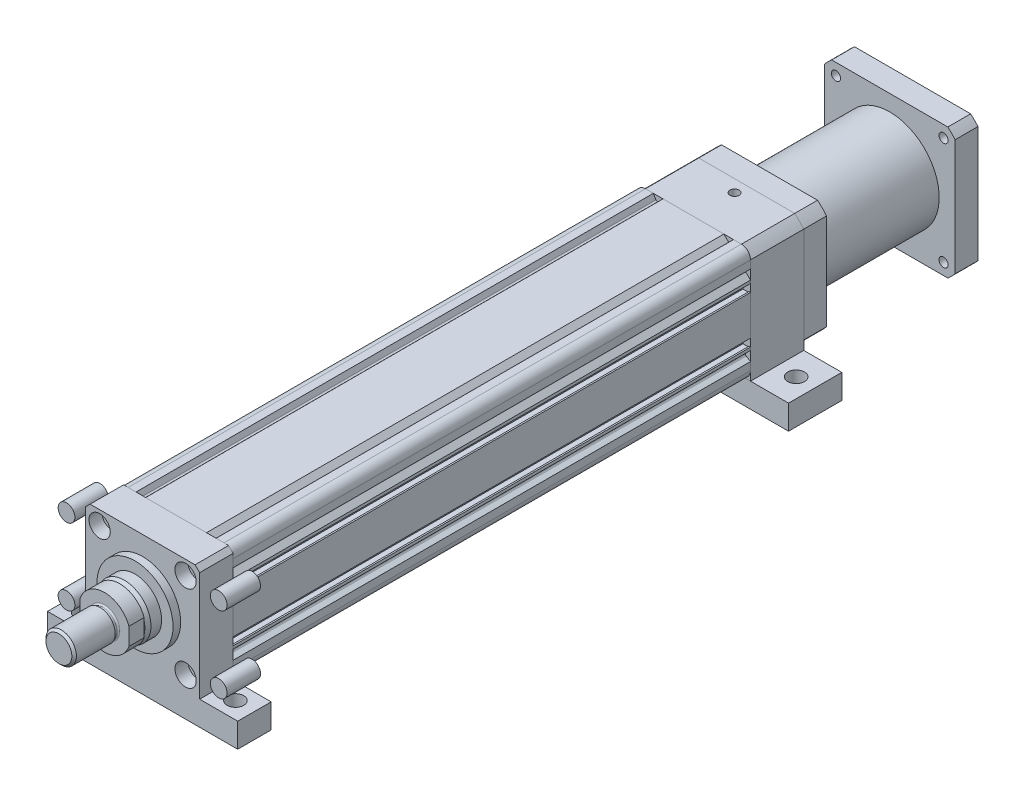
from build123d import *

# Parameters (mm, degrees)
SKETCH_1_R          = 31.5
SKETCH_1_R_2        = 3.35
EXTRUDE_1_DEPTH     = 340
SKETCH_2_R          = 5.5
EXTRUDE_1_2_DEPTH   = 22
EXTRUDE_1_2_2_DEPTH = 22
EXTRUDE_1_2_3_DEPTH = 22
EXTRUDE_1_2_4_DEPTH = 22
SKETCH_2_R_2        = 4.25
EXTRUDE_1_2_5_DEPTH = 22
SKETCH_3_R          = 7
SKETCH_3_R_2        = 4.25
CUT_EXTRUDE_1_DEPTH = 8.5
SKETCH_3_3_R        = 25
EXTRUDE_2_DEPTH     = 5
SKETCH_5_R          = 17.5
EXTRUDE_3_DEPTH     = 10
CHAMFER_1_SIZE      = 3
CHAMFER_1_SIZE2     = 1
EXTRUDE_4_DEPTH     = 10
SKETCH_8_R          = 9
EXTRUDE_5_DEPTH     = 3
SKETCH_9_R          = 10
EXTRUDE_6_DEPTH     = 27
CHAMFER_2_SIZE      = 1.5
FILLET_1_R          = 1
EXTRUDE_7_DEPTH     = 35
SKETCH_11_R         = 3
CUT_EXTRUDE_2_DEPTH = 5
EXTRUDE_8_DEPTH     = 15
SKETCH_13_R         = 32.5
EXTRUDE_9_DEPTH     = 79
SKETCH_14_R         = 3
EXTRUDE_10_DEPTH    = 15
SKETCH_15_R         = 40
CUT_EXTRUDE_3_DEPTH = 6
SKETCH_15_3_R       = 26
CUT_EXTRUDE_4_DEPTH = 101
SKETCH_18_W         = 125
SKETCH_18_H         = 22
SKETCH_18_R         = 5.5
SKETCH_18_H_2       = 35
EXTRUDE_11_DEPTH    = 16
CUT_EXTRUDE_5_DEPTH = 22
CHAMFER_3_SIZE      = 3


with BuildPart() as part:
    # Sketch 1 → Extrude 1 (new body)
    with BuildSketch(Plane.XY):
        with BuildLine():
            Line((-31.5, 37.5), (-26.33, 37.5))
            Line((-26.33, 37.5), (-24.66467188, 34.615567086))
            ThreePointArc((-24.66467188, 34.615567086), (-23.929172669, 34.124122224), (-23.091539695, 34.408460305))
            Line((-23.091539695, 34.408460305), (-20, 37.5))
            Line((-20, 37.5), (20, 37.5))
            Line((20, 37.5), (23.091539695, 34.408460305))
            ThreePointArc((23.091539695, 34.408460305), (23.929172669, 34.124122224), (24.66467188, 34.615567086))
            Line((24.66467188, 34.615567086), (26.33, 37.5))
            Line((26.33, 37.5), (31.5, 37.5))
            ThreePointArc((31.5, 37.5), (35.742640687, 35.742640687), (37.5, 31.5))
            Line((37.5, 31.5), (37.5, 26.33))
            Line((37.5, 26.33), (34.615567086, 24.66467188))
            ThreePointArc((34.615567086, 24.66467188), (34.124122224, 23.929172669), (34.408460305, 23.091539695))
            Line((34.408460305, 23.091539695), (37.5, 20))
            Line((37.5, 20), (37.5, 18.1))
            Line((37.5, 18.1), (36.5, 18.1))
            Line((36.5, 18.1), (36.5, 18.7))
            Line((36.5, 18.7), (32.5, 18.7))
            Line((32.5, 18.7), (32.5, 12.4))
            Line((32.5, 12.4), (36.5, 12.4))
            Line((36.5, 12.4), (36.5, 13))
            Line((36.5, 13), (37.5, 13))
            Line((37.5, 13), (37.5, -13))
            Line((37.5, -13), (36.5, -13))
            Line((36.5, -13), (36.5, -12.4))
            Line((36.5, -12.4), (32.5, -12.4))
            Line((32.5, -12.4), (32.5, -18.7))
            Line((32.5, -18.7), (36.5, -18.7))
            Line((36.5, -18.7), (36.5, -18.1))
            Line((36.5, -18.1), (37.5, -18.1))
            Line((37.5, -18.1), (37.5, -20))
            Line((37.5, -20), (34.408460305, -23.091539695))
            ThreePointArc((34.408460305, -23.091539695), (34.124122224, -23.929172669), (34.615567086, -24.66467188))
            Line((34.615567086, -24.66467188), (37.5, -26.33))
            Line((37.5, -26.33), (37.5, -31.5))
            ThreePointArc((37.5, -31.5), (35.742640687, -35.742640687), (31.5, -37.5))
            Line((31.5, -37.5), (26.33, -37.5))
            Line((26.33, -37.5), (24.66467188, -34.615567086))
            ThreePointArc((24.66467188, -34.615567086), (23.929172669, -34.124122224), (23.091539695, -34.408460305))
            Line((23.091539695, -34.408460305), (20, -37.5))
            Line((20, -37.5), (18.1, -37.5))
            Line((18.1, -37.5), (18.1, -36.5))
            Line((18.1, -36.5), (18.7, -36.5))
            Line((18.7, -36.5), (18.7, -33.945032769))
            Line((18.7, -33.945032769), (12.4, -33.945032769))
            Line((12.4, -33.945032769), (12.4, -36.5))
            Line((12.4, -36.5), (13, -36.5))
            Line((13, -36.5), (13, -37.5))
            Line((13, -37.5), (-13, -37.5))
            Line((-13, -37.5), (-13, -36.5))
            Line((-13, -36.5), (-12.4, -36.5))
            Line((-12.4, -36.5), (-12.4, -33.945032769))
            Line((-12.4, -33.945032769), (-18.7, -33.945032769))
            Line((-18.7, -33.945032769), (-18.7, -36.5))
            Line((-18.7, -36.5), (-18.1, -36.5))
            Line((-18.1, -36.5), (-18.1, -37.5))
            Line((-18.1, -37.5), (-20, -37.5))
            Line((-20, -37.5), (-23.091539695, -34.408460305))
            ThreePointArc((-23.091539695, -34.408460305), (-23.929172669, -34.124122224), (-24.66467188, -34.615567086))
            Line((-24.66467188, -34.615567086), (-26.33, -37.5))
            Line((-26.33, -37.5), (-31.5, -37.5))
            ThreePointArc((-31.5, -37.5), (-35.742640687, -35.742640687), (-37.5, -31.5))
            Line((-37.5, -31.5), (-37.5, -26.33))
            Line((-37.5, -26.33), (-34.615567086, -24.66467188))
            ThreePointArc((-34.615567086, -24.66467188), (-34.124122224, -23.929172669), (-34.408460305, -23.091539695))
            Line((-34.408460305, -23.091539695), (-37.5, -20))
            Line((-37.5, -20), (-37.5, -18.1))
            Line((-37.5, -18.1), (-36.5, -18.1))
            Line((-36.5, -18.1), (-36.5, -18.7))
            Line((-36.5, -18.7), (-32.5, -18.7))
            Line((-32.5, -18.7), (-32.5, -12.4))
            Line((-32.5, -12.4), (-36.5, -12.4))
            Line((-36.5, -12.4), (-36.5, -13))
            Line((-36.5, -13), (-37.5, -13))
            Line((-37.5, -13), (-37.5, 13))
            Line((-37.5, 13), (-36.5, 13))
            Line((-36.5, 13), (-36.5, 12.4))
            Line((-36.5, 12.4), (-32.5, 12.4))
            Line((-32.5, 12.4), (-32.5, 18.7))
            Line((-32.5, 18.7), (-36.5, 18.7))
            Line((-36.5, 18.7), (-36.5, 18.1))
            Line((-36.5, 18.1), (-37.5, 18.1))
            Line((-37.5, 18.1), (-37.5, 20))
            Line((-37.5, 20), (-34.408460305, 23.091539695))
            ThreePointArc((-34.408460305, 23.091539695), (-34.124122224, 23.929172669), (-34.615567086, 24.66467188))
            Line((-34.615567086, 24.66467188), (-37.5, 26.33))
            Line((-37.5, 26.33), (-37.5, 31.5))
            ThreePointArc((-37.5, 31.5), (-35.742640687, 35.742640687), (-31.5, 37.5))
        make_face()
        Circle(SKETCH_1_R, mode=Mode.SUBTRACT)
        with Locations((-28.25, 28.25)):
            Circle(SKETCH_1_R_2, mode=Mode.SUBTRACT)
        with Locations(Location((28.25, 28.25, 0), (0, 0, 180))):
            Circle(SKETCH_1_R_2, mode=Mode.SUBTRACT)
        with Locations((28.25, -28.25)):
            Circle(SKETCH_1_R_2, mode=Mode.SUBTRACT)
        with Locations(Location((-28.25, -28.25, 0), (0, 0, 180))):
            Circle(SKETCH_1_R_2, mode=Mode.SUBTRACT)
    extrude(amount=EXTRUDE_1_DEPTH)


with BuildPart() as body_2:
    # Sketch 2 → Extrude 1 2 (new body)
    with BuildSketch(Plane.XY.offset(340)):
        with Locations((-50, 25)):
            Circle(SKETCH_2_R)
    extrude(amount=EXTRUDE_1_2_DEPTH)


with BuildPart() as body_3:
    # Sketch 2 → Extrude 1 2 2 (new body)
    with BuildSketch(Plane.XY.offset(340)):
        with Locations(Location((50, 25, 0), (0, 0, 180))):
            Circle(SKETCH_2_R)
    extrude(amount=EXTRUDE_1_2_2_DEPTH)


with BuildPart() as body_4:
    # Sketch 2 → Extrude 1 2 3 (new body)
    with BuildSketch(Plane.XY.offset(340)):
        with Locations(Location((-50, -25, 0), (0, 0, 180))):
            Circle(SKETCH_2_R)
    extrude(amount=EXTRUDE_1_2_3_DEPTH)


with BuildPart() as body_5:
    # Sketch 2 → Extrude 1 2 4 (new body)
    with BuildSketch(Plane.XY.offset(340)):
        with Locations((50, -25)):
            Circle(SKETCH_2_R)
    extrude(amount=EXTRUDE_1_2_4_DEPTH)


with BuildPart() as body_6:
    # Sketch 2 → Extrude 1 2 5 (new body)
    with BuildSketch(Plane.XY.offset(340)):
        Polygon((-40, 37), (-37, 40), (37, 40), (40, 37), (40, -37), (40, -40), (37, -40), (-37, -40), (-40, -40), (-40, -37), align=None)
        with Locations((-28.25, 28.25)):
            Circle(SKETCH_2_R_2, mode=Mode.SUBTRACT)
        with Locations(Location((28.25, 28.25, 0), (0, 0, 180))):
            Circle(SKETCH_2_R_2, mode=Mode.SUBTRACT)
        with Locations(Location((-28.25, -28.25, 0), (0, 0, 180))):
            Circle(SKETCH_2_R_2, mode=Mode.SUBTRACT)
        with Locations((28.25, -28.25)):
            Circle(SKETCH_2_R_2, mode=Mode.SUBTRACT)
    extrude(amount=EXTRUDE_1_2_5_DEPTH)

    # Sketch 3 → Cut-Extrude 1 (cut)
    # profile 1 of 4: a face of its own
    with BuildSketch(Plane.XY.offset(362)):
        with Locations((28.25, -28.25)):
            Circle(SKETCH_3_R)
        with Locations((28.25, -28.25)):
            Circle(SKETCH_3_R_2, mode=Mode.SUBTRACT)
    # profile 2 of 4: a face of its own
    with BuildSketch(Plane.XY.offset(362)):
        with Locations((-28.25, -28.25)):
            Circle(SKETCH_3_R)
        with Locations(Location((-28.25, -28.25, 0), (0, 0, 180))):
            Circle(SKETCH_3_R_2, mode=Mode.SUBTRACT)
    # profile 3 of 4: a face of its own
    with BuildSketch(Plane.XY.offset(362)):
        with Locations((-28.25, 28.25)):
            Circle(SKETCH_3_R)
    # profile 4 of 4: a face of its own
    with BuildSketch(Plane.XY.offset(362)):
        with Locations((28.25, 28.25)):
            Circle(SKETCH_3_R)
    extrude(amount=-CUT_EXTRUDE_1_DEPTH, mode=Mode.SUBTRACT)

    # Sketch 3_3 → Extrude 2 (add)
    with BuildSketch(Plane.XY.offset(362)):
        Circle(SKETCH_3_3_R)
    extrude(amount=EXTRUDE_2_DEPTH)

    # Sketch 5 → Extrude 3 (add)
    with BuildSketch(Plane.XY.offset(367)):
        Circle(SKETCH_5_R)
    extrude(amount=EXTRUDE_3_DEPTH)

    # Chamfer 1
    chamfer_1_edges = [body_6.edges().sort_by_distance(p)[0] for p in [
        (-17.5, 0, 377),
    ]]
    chamfer_1_side = [body_6.faces().sort_by_distance(p)[0] for p in [
        (-17.5, 0, 372),
    ]]
    chamfer(chamfer_1_edges, length=CHAMFER_1_SIZE, length2=CHAMFER_1_SIZE2, reference=chamfer_1_side[0])

    # Sketch 6 → Extrude 4 (add)
    with BuildSketch(Plane.XY.offset(377)):
        with BuildLine():
            Line((-16, 5.744562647), (-16, -5.744562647))
            ThreePointArc((-16, -5.744562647), (0, -17), (16, -5.744562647))
            Line((16, -5.744562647), (16, 5.744562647))
            ThreePointArc((16, 5.744562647), (0, 17), (-16, 5.744562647))
        make_face()
    extrude(amount=EXTRUDE_4_DEPTH)

    # Sketch 8 → Extrude 5 (add)
    with BuildSketch(Plane.XY.offset(387)):
        Circle(SKETCH_8_R)
    extrude(amount=EXTRUDE_5_DEPTH)

    # Sketch 9 → Extrude 6 (add)
    with BuildSketch(Plane.XY.offset(390)):
        Circle(SKETCH_9_R)
    extrude(amount=EXTRUDE_6_DEPTH)

    # Chamfer 2
    chamfer_2_edges = [body_6.edges().sort_by_distance(p)[0] for p in [
        (-10, 0, 417),
    ]]
    chamfer(chamfer_2_edges, length=CHAMFER_2_SIZE)

    # Fillet 1
    fillet_1_edges = [body_6.edges().sort_by_distance(p)[0] for p in [
        (-9, 0, 387),
    ]]
    fillet(fillet_1_edges, radius=FILLET_1_R)

    # Sketch 18 → Extrude 11 (add)
    # profile 1 of 2: a face of its own
    with BuildSketch(Plane.XZ.offset(37.5)):
        with Locations((0, 351)):
            Rectangle(SKETCH_18_W, SKETCH_18_H)
        with Locations(Location((-50, 351, 0), (0, 0, 270))):
            Circle(SKETCH_18_R, mode=Mode.SUBTRACT)
        with Locations(Location((50, 351, 0), (0, 0, 270))):
            Circle(SKETCH_18_R, mode=Mode.SUBTRACT)
    # profile 2 of 2: a face of its own
    with BuildSketch(Plane.XZ.offset(37.5)):
        with Locations((0, -17.5)):
            Rectangle(SKETCH_18_W, SKETCH_18_H_2)
        with Locations(Location((-50, -17.5, 0), (0, 0, 270))):
            Circle(SKETCH_18_R, mode=Mode.SUBTRACT)
        with Locations(Location((50, -17.5, 0), (0, 0, 270))):
            Circle(SKETCH_18_R, mode=Mode.SUBTRACT)
    extrude(amount=EXTRUDE_11_DEPTH)


with BuildPart() as body_7:
    # Sketch 10 → Extrude 7 (new body)
    with BuildSketch(Plane(origin=(0, 0, 0), x_dir=(-1, 0, 0), z_dir=(0, 0, -1))):
        with BuildLine():
            Line((37.5, -31.539657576), (37.5, -37.5))
            Line((37.5, -37.5), (31.539657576, -37.5))
            Line((31.539657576, -37.5), (-31.539657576, -37.5))
            Line((-31.539657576, -37.5), (-37.5, -37.5))
            Line((-37.5, -37.5), (-37.5, -31.539657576))
            Line((-37.5, -31.539657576), (-37.5, 31.539657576))
            ThreePointArc((-37.5, 31.539657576), (-34.648232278, 34.648232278), (-31.539657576, 37.5))
            Line((-31.539657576, 37.5), (31.539657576, 37.5))
            ThreePointArc((31.539657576, 37.5), (34.648232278, 34.648232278), (37.5, 31.539657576))
            Line((37.5, 31.539657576), (37.5, -31.539657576))
        make_face()
    extrude(amount=EXTRUDE_7_DEPTH)

    # Sketch 11 → Cut-Extrude 2 (cut)
    with BuildSketch(Plane(origin=(0, 37.5, 0), x_dir=(1, 0, 0), z_dir=(0, 1, 0))):
        with Locations(Location((0, 27, 0), (0, 0, 270))):
            Circle(SKETCH_11_R)
    extrude(amount=-CUT_EXTRUDE_2_DEPTH, mode=Mode.SUBTRACT)


with BuildPart() as body_8:
    # Sketch 12 → Extrude 8 (new body)
    with BuildSketch(Plane(origin=(0, 0, -35), x_dir=(-1, 0, 0), z_dir=(0, 0, -1))):
        with BuildLine():
            Line((-31.539657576, 37.5), (31.539657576, 37.5))
            ThreePointArc((31.539657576, 37.5), (34.648232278, 34.648232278), (37.5, 31.539657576))
            Line((37.5, 31.539657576), (37.5, -31.539657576))
            ThreePointArc((37.5, -31.539657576), (34.648232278, -34.648232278), (31.539657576, -37.5))
            Line((31.539657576, -37.5), (-31.539657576, -37.5))
            ThreePointArc((-31.539657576, -37.5), (-34.648232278, -34.648232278), (-37.5, -31.539657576))
            Line((-37.5, -31.539657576), (-37.5, 31.539657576))
            ThreePointArc((-37.5, 31.539657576), (-34.648232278, 34.648232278), (-31.539657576, 37.5))
        make_face()
    extrude(amount=EXTRUDE_8_DEPTH)

    # Sketch 13 → Extrude 9 (add)
    with BuildSketch(Plane(origin=(0, 0, -50), x_dir=(-1, 0, 0), z_dir=(0, 0, -1))):
        Circle(SKETCH_13_R)
    extrude(amount=EXTRUDE_9_DEPTH)

    # Sketch 14 → Extrude 10 (add)
    with BuildSketch(Plane(origin=(0, 0, -129), x_dir=(-1, 0, 0), z_dir=(0, 0, -1))):
        with BuildLine():
            Line((-38.173943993, 43), (38.173943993, 43))
            ThreePointArc((38.173943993, 43), (40.658639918, 40.658639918), (43, 38.173943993))
            Line((43, 38.173943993), (43, -38.173943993))
            ThreePointArc((43, -38.173943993), (40.658639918, -40.658639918), (38.173943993, -43))
            Line((38.173943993, -43), (-38.173943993, -43))
            ThreePointArc((-38.173943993, -43), (-40.658639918, -40.658639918), (-43, -38.173943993))
            Line((-43, -38.173943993), (-43, 38.173943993))
            ThreePointArc((-43, 38.173943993), (-40.658639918, 40.658639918), (-38.173943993, 43))
        make_face()
        with Locations((-35.355339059, 35.355339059)):
            Circle(SKETCH_14_R, mode=Mode.SUBTRACT)
        with Locations((35.355339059, 35.355339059)):
            Circle(SKETCH_14_R, mode=Mode.SUBTRACT)
        with Locations((35.355339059, -35.355339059)):
            Circle(SKETCH_14_R, mode=Mode.SUBTRACT)
        with Locations((-35.355339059, -35.355339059)):
            Circle(SKETCH_14_R, mode=Mode.SUBTRACT)
    extrude(amount=EXTRUDE_10_DEPTH)

    # Sketch 15 → Cut-Extrude 3 (cut)
    with BuildSketch(Plane(origin=(0, 0, -144), x_dir=(-1, 0, 0), z_dir=(0, 0, -1))):
        Circle(SKETCH_15_R)
    extrude(amount=-CUT_EXTRUDE_3_DEPTH, mode=Mode.SUBTRACT)

    # Sketch 15_3 → Cut-Extrude 4 (cut)
    with BuildSketch(Plane(origin=(0, 0, -144), x_dir=(-1, 0, 0), z_dir=(0, 0, -1))):
        Circle(SKETCH_15_3_R)
    extrude(amount=-CUT_EXTRUDE_4_DEPTH, mode=Mode.SUBTRACT)


with BuildPart() as extrude_11_piece_1:
    # of the separate pieces the step leaves, piece 1, a body of its own (extrude_11_pieces)
    add(body_6.part.solids().sort_by_distance((9, 0, 388))[0])

    # Sketch 19 → Cut-Extrude 5 (cut)
    with BuildSketch(Plane.XY.offset(362)):
        Polygon((-47.545494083, -37.5), (-37.5, -37.5), (-37.5, 37.5), (37.5, 37.5), (37.5, -37.5), (45.951790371, -37.5), (47.943920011, 44.088410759), (-67.466790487, 44.088410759), align=None)
    extrude(amount=-CUT_EXTRUDE_5_DEPTH, mode=Mode.SUBTRACT)

    # Chamfer 3
    chamfer_3_edges = [extrude_11_piece_1.edges().sort_by_distance(p)[0] for p in [
        (37.5, 37.5, 351),
        (-37.5, 37.5, 351),
    ]]
    chamfer(chamfer_3_edges, length=CHAMFER_3_SIZE)


with BuildPart() as extrude_11_piece_2:
    # of the separate pieces the step leaves, piece 2, a body of its own (extrude_11_pieces)
    add(body_6.part.solids().sort_by_distance((-62.5, -37.5, -35))[0])


solid = Compound([part.part, body_2.part, body_3.part, body_4.part, body_5.part, body_7.part, body_8.part, extrude_11_piece_1.part, extrude_11_piece_2.part])
